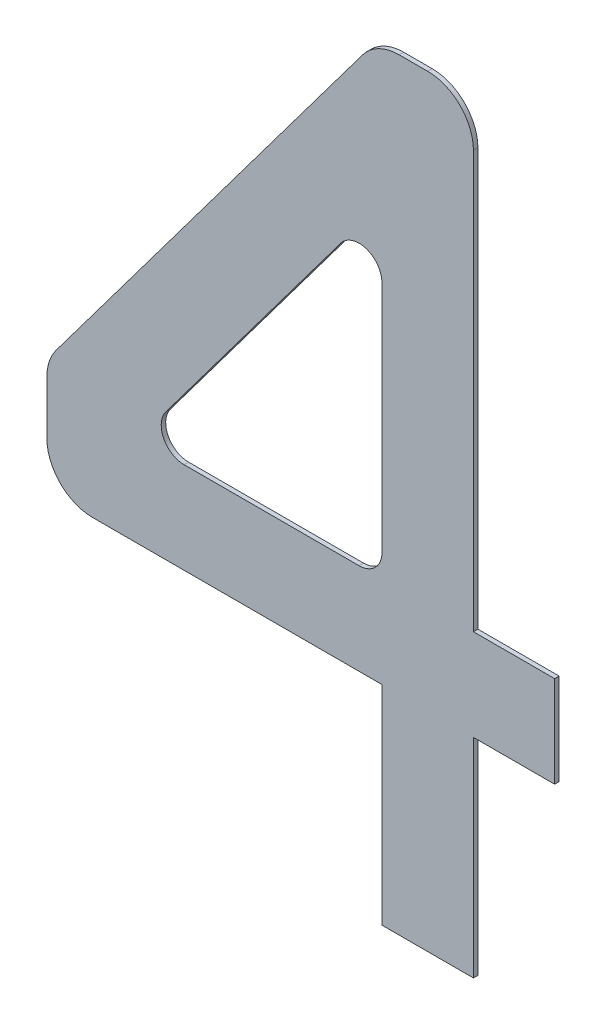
ISO-10303-21;
HEADER;
FILE_DESCRIPTION(('STEP AP214'),'2;1');
FILE_NAME('part.step','',(''),(''),'','','');
FILE_SCHEMA(('AUTOMOTIVE_DESIGN { 1 0 10303 214 1 1 1 1 }'));
ENDSEC;
DATA;
#1=APPLICATION_CONTEXT('core data for automotive mechanical design processes');
#2=APPLICATION_PROTOCOL_DEFINITION('international standard','automotive_design',2000,#1);
#3=PRODUCT_CONTEXT('',#1,'mechanical');
#4=PRODUCT('Part','Part','',(#3));
#5=PRODUCT_RELATED_PRODUCT_CATEGORY('part','',(#4));
#6=PRODUCT_DEFINITION_FORMATION('','',#4);
#7=PRODUCT_DEFINITION_CONTEXT('part definition',#1,'design');
#8=PRODUCT_DEFINITION('design','',#6,#7);
#9=PRODUCT_DEFINITION_SHAPE('','',#8);
#10=(LENGTH_UNIT() NAMED_UNIT(*) SI_UNIT(.MILLI.,.METRE.));
#11=(NAMED_UNIT(*) PLANE_ANGLE_UNIT() SI_UNIT($,.RADIAN.));
#12=(NAMED_UNIT(*) SI_UNIT($,.STERADIAN.) SOLID_ANGLE_UNIT());
#13=UNCERTAINTY_MEASURE_WITH_UNIT(LENGTH_MEASURE(1.E-05),#10,'distance_accuracy_value','');
#14=(GEOMETRIC_REPRESENTATION_CONTEXT(3) GLOBAL_UNCERTAINTY_ASSIGNED_CONTEXT((#13)) GLOBAL_UNIT_ASSIGNED_CONTEXT((#10,
#11,#12)) REPRESENTATION_CONTEXT('',''));
#15=CARTESIAN_POINT('',(0.,0.,0.));
#16=DIRECTION('',(0.,0.,1.));
#17=DIRECTION('',(1.,0.,0.));
#18=AXIS2_PLACEMENT_3D('',#15,#16,#17);
#19=CARTESIAN_POINT('',(2.19559999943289,15.98,0.1));
#20=DIRECTION('',(0.,0.,1.));
#21=DIRECTION('',(1.,0.,0.));
#22=AXIS2_PLACEMENT_3D('',#19,#20,#21);
#23=PLANE('',#22);
#24=CARTESIAN_POINT('',(2.19559999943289,15.98,0.1));
#25=DIRECTION('',(0.,0.,1.));
#26=DIRECTION('',(1.,0.,0.));
#27=AXIS2_PLACEMENT_3D('',#24,#25,#26);
#28=CIRCLE('',#27,1.02);
#29=CARTESIAN_POINT('',(2.19559999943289,17.,0.1));
#30=VERTEX_POINT('',#29);
#31=CARTESIAN_POINT('',(1.37930622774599,16.5916081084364,0.1));
#32=VERTEX_POINT('',#31);
#33=EDGE_CURVE('E280',#30,#32,#28,.T.);
#34=ORIENTED_EDGE('',*,*,#33,.T.);
#35=DIRECTION('',(0.599615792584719,0.80028801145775,0.));
#36=VECTOR('',#35,1.);
#37=CARTESIAN_POINT('',(-5.4572937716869,7.46701685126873,0.1));
#38=LINE('',#37,#36);
#39=CARTESIAN_POINT('',(-5.4572937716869,7.46701685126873,0.1));
#40=VERTEX_POINT('',#39);
#41=EDGE_CURVE('E282',#40,#32,#38,.T.);
#42=ORIENTED_EDGE('',*,*,#41,.F.);
#43=CARTESIAN_POINT('',(-4.641,6.85540874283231,0.1));
#44=DIRECTION('',(0.,0.,1.));
#45=DIRECTION('',(1.,0.,0.));
#46=AXIS2_PLACEMENT_3D('',#43,#44,#45);
#47=CIRCLE('',#46,1.02);
#48=CARTESIAN_POINT('',(-5.661,6.85540874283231,0.1));
#49=VERTEX_POINT('',#48);
#50=EDGE_CURVE('E286',#40,#49,#47,.T.);
#51=ORIENTED_EDGE('',*,*,#50,.T.);
#52=DIRECTION('',(0.,-1.,0.));
#53=VECTOR('',#52,1.);
#54=CARTESIAN_POINT('',(-5.661,6.85540874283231,0.1));
#55=LINE('',#54,#53);
#56=CARTESIAN_POINT('',(-5.661,5.66666666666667,0.1));
#57=VERTEX_POINT('',#56);
#58=EDGE_CURVE('E289',#49,#57,#55,.T.);
#59=ORIENTED_EDGE('',*,*,#58,.T.);
#60=CARTESIAN_POINT('',(-4.641,5.66666666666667,0.1));
#61=DIRECTION('',(0.,0.,1.));
#62=DIRECTION('',(1.,0.,0.));
#63=AXIS2_PLACEMENT_3D('',#60,#61,#62);
#64=CIRCLE('',#63,1.02);
#65=CARTESIAN_POINT('',(-4.641,4.64666666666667,0.1));
#66=VERTEX_POINT('',#65);
#67=EDGE_CURVE('E292',#57,#66,#64,.T.);
#68=ORIENTED_EDGE('',*,*,#67,.T.);
#69=DIRECTION('',(1.,0.,0.));
#70=VECTOR('',#69,1.);
#71=CARTESIAN_POINT('',(-4.641,4.64666666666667,0.1));
#72=LINE('',#71,#70);
#73=CARTESIAN_POINT('',(1.8105,4.64666666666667,0.1));
#74=VERTEX_POINT('',#73);
#75=EDGE_CURVE('E295',#66,#74,#72,.T.);
#76=ORIENTED_EDGE('',*,*,#75,.T.);
#77=DIRECTION('',(0.,1.,0.));
#78=VECTOR('',#77,1.);
#79=CARTESIAN_POINT('',(1.8105,0.,0.1));
#80=LINE('',#79,#78);
#81=CARTESIAN_POINT('',(1.8105,0.,0.1));
#82=VERTEX_POINT('',#81);
#83=EDGE_CURVE('E298',#82,#74,#80,.T.);
#84=ORIENTED_EDGE('',*,*,#83,.F.);
#85=DIRECTION('',(1.,0.,0.));
#86=VECTOR('',#85,1.);
#87=CARTESIAN_POINT('',(1.8105,0.,0.1));
#88=LINE('',#87,#86);
#89=CARTESIAN_POINT('',(3.8505,0.,0.1));
#90=VERTEX_POINT('',#89);
#91=EDGE_CURVE('E302',#82,#90,#88,.T.);
#92=ORIENTED_EDGE('',*,*,#91,.T.);
#93=DIRECTION('',(0.,1.,0.));
#94=VECTOR('',#93,1.);
#95=CARTESIAN_POINT('',(3.8505,0.,0.1));
#96=LINE('',#95,#94);
#97=CARTESIAN_POINT('',(3.8505,4.64666666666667,0.1));
#98=VERTEX_POINT('',#97);
#99=EDGE_CURVE('E305',#90,#98,#96,.T.);
#100=ORIENTED_EDGE('',*,*,#99,.T.);
#101=DIRECTION('',(1.,0.,0.));
#102=VECTOR('',#101,1.);
#103=CARTESIAN_POINT('',(3.8505,4.64666666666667,0.1));
#104=LINE('',#103,#102);
#105=CARTESIAN_POINT('',(5.661,4.64666666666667,0.1));
#106=VERTEX_POINT('',#105);
#107=EDGE_CURVE('E308',#98,#106,#104,.T.);
#108=ORIENTED_EDGE('',*,*,#107,.T.);
#109=DIRECTION('',(0.,-1.,0.));
#110=VECTOR('',#109,1.);
#111=CARTESIAN_POINT('',(5.661,6.68666666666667,0.1));
#112=LINE('',#111,#110);
#113=CARTESIAN_POINT('',(5.661,6.68666666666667,0.1));
#114=VERTEX_POINT('',#113);
#115=EDGE_CURVE('E311',#114,#106,#112,.T.);
#116=ORIENTED_EDGE('',*,*,#115,.F.);
#117=DIRECTION('',(1.,0.,0.));
#118=VECTOR('',#117,1.);
#119=CARTESIAN_POINT('',(3.8505,6.68666666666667,0.1));
#120=LINE('',#119,#118);
#121=CARTESIAN_POINT('',(3.8505,6.68666666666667,0.1));
#122=VERTEX_POINT('',#121);
#123=EDGE_CURVE('E315',#122,#114,#120,.T.);
#124=ORIENTED_EDGE('',*,*,#123,.F.);
#125=DIRECTION('',(0.,1.,0.));
#126=VECTOR('',#125,1.);
#127=CARTESIAN_POINT('',(3.8505,6.68666666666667,0.1));
#128=LINE('',#127,#126);
#129=CARTESIAN_POINT('',(3.8505,15.98,0.1));
#130=VERTEX_POINT('',#129);
#131=EDGE_CURVE('E319',#122,#130,#128,.T.);
#132=ORIENTED_EDGE('',*,*,#131,.T.);
#133=CARTESIAN_POINT('',(2.8305,15.98,0.1));
#134=DIRECTION('',(0.,0.,1.));
#135=DIRECTION('',(1.,0.,0.));
#136=AXIS2_PLACEMENT_3D('',#133,#134,#135);
#137=CIRCLE('',#136,1.02);
#138=CARTESIAN_POINT('',(2.8305,17.,0.1));
#139=VERTEX_POINT('',#138);
#140=EDGE_CURVE('E322',#130,#139,#137,.T.);
#141=ORIENTED_EDGE('',*,*,#140,.T.);
#142=DIRECTION('',(-1.,0.,0.));
#143=VECTOR('',#142,1.);
#144=CARTESIAN_POINT('',(2.8305,17.,0.1));
#145=LINE('',#144,#143);
#146=EDGE_CURVE('E325',#139,#30,#145,.T.);
#147=ORIENTED_EDGE('',*,*,#146,.T.);
#148=EDGE_LOOP('',(#34,#42,#51,#59,#68,#76,#84,#92,#100,#108,#116,#124,#132,#141,#147));
#149=FACE_BOUND('',#148,.T.);
#150=CARTESIAN_POINT('',(1.3005,12.4046905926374,0.1));
#151=DIRECTION('',(0.,0.,1.));
#152=DIRECTION('',(1.,0.,0.));
#153=AXIS2_PLACEMENT_3D('',#150,#151,#152);
#154=CIRCLE('',#153,0.51);
#155=CARTESIAN_POINT('',(0.892353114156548,12.7104946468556,0.1));
#156=VERTEX_POINT('',#155);
#157=CARTESIAN_POINT('',(1.8105,12.4046905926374,0.1));
#158=VERTEX_POINT('',#157);
#159=EDGE_CURVE('E221',#156,#158,#154,.F.);
#160=ORIENTED_EDGE('',*,*,#159,.T.);
#161=DIRECTION('',(0.,-1.,0.));
#162=VECTOR('',#161,1.);
#163=CARTESIAN_POINT('',(1.8105,15.98,0.1));
#164=LINE('',#163,#162);
#165=CARTESIAN_POINT('',(1.8105,7.19666666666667,0.1));
#166=VERTEX_POINT('',#165);
#167=EDGE_CURVE('E213',#158,#166,#164,.T.);
#168=ORIENTED_EDGE('',*,*,#167,.T.);
#169=CARTESIAN_POINT('',(1.3005,7.19666666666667,0.1));
#170=DIRECTION('',(0.,0.,1.));
#171=DIRECTION('',(1.,0.,0.));
#172=AXIS2_PLACEMENT_3D('',#169,#170,#171);
#173=CIRCLE('',#172,0.51);
#174=CARTESIAN_POINT('',(1.3005,6.68666666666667,0.1));
#175=VERTEX_POINT('',#174);
#176=EDGE_CURVE('E201',#166,#175,#173,.F.);
#177=ORIENTED_EDGE('',*,*,#176,.T.);
#178=DIRECTION('',(1.,0.,0.));
#179=VECTOR('',#178,1.);
#180=CARTESIAN_POINT('',(2.19559999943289,6.68666666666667,0.1));
#181=LINE('',#180,#179);
#182=CARTESIAN_POINT('',(-2.60161192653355,6.68666666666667,0.1));
#183=VERTEX_POINT('',#182);
#184=EDGE_CURVE('E207',#183,#175,#181,.T.);
#185=ORIENTED_EDGE('',*,*,#184,.F.);
#186=CARTESIAN_POINT('',(-2.60161192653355,7.19666666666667,0.1));
#187=DIRECTION('',(0.,0.,1.));
#188=DIRECTION('',(1.,0.,0.));
#189=AXIS2_PLACEMENT_3D('',#186,#187,#188);
#190=CIRCLE('',#189,0.51);
#191=CARTESIAN_POINT('',(-3.00975881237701,7.50247072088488,0.1));
#192=VERTEX_POINT('',#191);
#193=EDGE_CURVE('E425',#183,#192,#190,.F.);
#194=ORIENTED_EDGE('',*,*,#193,.T.);
#195=DIRECTION('',(-0.599615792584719,-0.80028801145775,0.));
#196=VECTOR('',#195,1.);
#197=CARTESIAN_POINT('',(2.92984359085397,15.4298679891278,0.1));
#198=LINE('',#197,#196);
#199=EDGE_CURVE('E231',#156,#192,#198,.T.);
#200=ORIENTED_EDGE('',*,*,#199,.F.);
#201=EDGE_LOOP('',(#160,#168,#177,#185,#194,#200));
#202=FACE_BOUND('',#201,.T.);
#203=ADVANCED_FACE('F14',(#149,#202),#23,.T.);
#204=CARTESIAN_POINT('',(2.19559999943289,15.98,0.));
#205=DIRECTION('',(0.,0.,1.));
#206=DIRECTION('',(1.,0.,0.));
#207=AXIS2_PLACEMENT_3D('',#204,#205,#206);
#208=PLANE('',#207);
#209=CARTESIAN_POINT('',(2.19559999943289,15.98,0.));
#210=DIRECTION('',(0.,0.,1.));
#211=DIRECTION('',(1.,0.,0.));
#212=AXIS2_PLACEMENT_3D('',#209,#210,#211);
#213=CIRCLE('',#212,1.02);
#214=CARTESIAN_POINT('',(2.19559999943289,17.,0.));
#215=VERTEX_POINT('',#214);
#216=CARTESIAN_POINT('',(1.37930622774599,16.5916081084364,0.));
#217=VERTEX_POINT('',#216);
#218=EDGE_CURVE('E223',#215,#217,#213,.T.);
#219=ORIENTED_EDGE('',*,*,#218,.F.);
#220=DIRECTION('',(-1.,0.,0.));
#221=VECTOR('',#220,1.);
#222=CARTESIAN_POINT('',(2.8305,17.,0.));
#223=LINE('',#222,#221);
#224=CARTESIAN_POINT('',(2.8305,17.,0.));
#225=VERTEX_POINT('',#224);
#226=EDGE_CURVE('E279',#225,#215,#223,.T.);
#227=ORIENTED_EDGE('',*,*,#226,.F.);
#228=CARTESIAN_POINT('',(2.8305,15.98,0.));
#229=DIRECTION('',(0.,0.,1.));
#230=DIRECTION('',(1.,0.,0.));
#231=AXIS2_PLACEMENT_3D('',#228,#229,#230);
#232=CIRCLE('',#231,1.02);
#233=CARTESIAN_POINT('',(3.8505,15.98,0.));
#234=VERTEX_POINT('',#233);
#235=EDGE_CURVE('E276',#234,#225,#232,.T.);
#236=ORIENTED_EDGE('',*,*,#235,.F.);
#237=DIRECTION('',(0.,1.,0.));
#238=VECTOR('',#237,1.);
#239=CARTESIAN_POINT('',(3.8505,6.68666666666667,0.));
#240=LINE('',#239,#238);
#241=CARTESIAN_POINT('',(3.8505,6.68666666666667,0.));
#242=VERTEX_POINT('',#241);
#243=EDGE_CURVE('E273',#242,#234,#240,.T.);
#244=ORIENTED_EDGE('',*,*,#243,.F.);
#245=DIRECTION('',(1.,0.,0.));
#246=VECTOR('',#245,1.);
#247=CARTESIAN_POINT('',(3.8505,6.68666666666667,0.));
#248=LINE('',#247,#246);
#249=CARTESIAN_POINT('',(5.661,6.68666666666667,0.));
#250=VERTEX_POINT('',#249);
#251=EDGE_CURVE('E269',#242,#250,#248,.T.);
#252=ORIENTED_EDGE('',*,*,#251,.T.);
#253=DIRECTION('',(0.,-1.,0.));
#254=VECTOR('',#253,1.);
#255=CARTESIAN_POINT('',(5.661,6.68666666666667,0.));
#256=LINE('',#255,#254);
#257=CARTESIAN_POINT('',(5.661,4.64666666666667,0.));
#258=VERTEX_POINT('',#257);
#259=EDGE_CURVE('E265',#250,#258,#256,.T.);
#260=ORIENTED_EDGE('',*,*,#259,.T.);
#261=DIRECTION('',(1.,0.,0.));
#262=VECTOR('',#261,1.);
#263=CARTESIAN_POINT('',(3.8505,4.64666666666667,0.));
#264=LINE('',#263,#262);
#265=CARTESIAN_POINT('',(3.8505,4.64666666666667,0.));
#266=VERTEX_POINT('',#265);
#267=EDGE_CURVE('E261',#266,#258,#264,.T.);
#268=ORIENTED_EDGE('',*,*,#267,.F.);
#269=DIRECTION('',(0.,1.,0.));
#270=VECTOR('',#269,1.);
#271=CARTESIAN_POINT('',(3.8505,0.,0.));
#272=LINE('',#271,#270);
#273=CARTESIAN_POINT('',(3.8505,0.,0.));
#274=VERTEX_POINT('',#273);
#275=EDGE_CURVE('E258',#274,#266,#272,.T.);
#276=ORIENTED_EDGE('',*,*,#275,.F.);
#277=DIRECTION('',(1.,0.,0.));
#278=VECTOR('',#277,1.);
#279=CARTESIAN_POINT('',(1.8105,0.,0.));
#280=LINE('',#279,#278);
#281=CARTESIAN_POINT('',(1.8105,0.,0.));
#282=VERTEX_POINT('',#281);
#283=EDGE_CURVE('E255',#282,#274,#280,.T.);
#284=ORIENTED_EDGE('',*,*,#283,.F.);
#285=DIRECTION('',(0.,1.,0.));
#286=VECTOR('',#285,1.);
#287=CARTESIAN_POINT('',(1.8105,0.,0.));
#288=LINE('',#287,#286);
#289=CARTESIAN_POINT('',(1.8105,4.64666666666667,0.));
#290=VERTEX_POINT('',#289);
#291=EDGE_CURVE('E251',#282,#290,#288,.T.);
#292=ORIENTED_EDGE('',*,*,#291,.T.);
#293=DIRECTION('',(1.,0.,0.));
#294=VECTOR('',#293,1.);
#295=CARTESIAN_POINT('',(-4.641,4.64666666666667,0.));
#296=LINE('',#295,#294);
#297=CARTESIAN_POINT('',(-4.641,4.64666666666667,0.));
#298=VERTEX_POINT('',#297);
#299=EDGE_CURVE('E247',#298,#290,#296,.T.);
#300=ORIENTED_EDGE('',*,*,#299,.F.);
#301=CARTESIAN_POINT('',(-4.641,5.66666666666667,0.));
#302=DIRECTION('',(0.,0.,1.));
#303=DIRECTION('',(1.,0.,0.));
#304=AXIS2_PLACEMENT_3D('',#301,#302,#303);
#305=CIRCLE('',#304,1.02);
#306=CARTESIAN_POINT('',(-5.661,5.66666666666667,0.));
#307=VERTEX_POINT('',#306);
#308=EDGE_CURVE('E244',#307,#298,#305,.T.);
#309=ORIENTED_EDGE('',*,*,#308,.F.);
#310=DIRECTION('',(0.,-1.,0.));
#311=VECTOR('',#310,1.);
#312=CARTESIAN_POINT('',(-5.661,6.85540874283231,0.));
#313=LINE('',#312,#311);
#314=CARTESIAN_POINT('',(-5.661,6.85540874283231,0.));
#315=VERTEX_POINT('',#314);
#316=EDGE_CURVE('E241',#315,#307,#313,.T.);
#317=ORIENTED_EDGE('',*,*,#316,.F.);
#318=CARTESIAN_POINT('',(-4.641,6.85540874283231,0.));
#319=DIRECTION('',(0.,0.,1.));
#320=DIRECTION('',(1.,0.,0.));
#321=AXIS2_PLACEMENT_3D('',#318,#319,#320);
#322=CIRCLE('',#321,1.02);
#323=CARTESIAN_POINT('',(-5.4572937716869,7.46701685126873,0.));
#324=VERTEX_POINT('',#323);
#325=EDGE_CURVE('E238',#324,#315,#322,.T.);
#326=ORIENTED_EDGE('',*,*,#325,.F.);
#327=DIRECTION('',(0.599615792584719,0.80028801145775,0.));
#328=VECTOR('',#327,1.);
#329=CARTESIAN_POINT('',(-5.4572937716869,7.46701685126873,0.));
#330=LINE('',#329,#328);
#331=EDGE_CURVE('E229',#324,#217,#330,.T.);
#332=ORIENTED_EDGE('',*,*,#331,.T.);
#333=EDGE_LOOP('',(#219,#227,#236,#244,#252,#260,#268,#276,#284,#292,#300,#309,#317,#326,#332));
#334=FACE_BOUND('',#333,.T.);
#335=DIRECTION('',(0.,-1.,0.));
#336=VECTOR('',#335,1.);
#337=CARTESIAN_POINT('',(1.8105,15.98,0.));
#338=LINE('',#337,#336);
#339=CARTESIAN_POINT('',(1.8105,12.4046905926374,0.));
#340=VERTEX_POINT('',#339);
#341=CARTESIAN_POINT('',(1.8105,7.19666666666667,0.));
#342=VERTEX_POINT('',#341);
#343=EDGE_CURVE('E9',#340,#342,#338,.T.);
#344=ORIENTED_EDGE('',*,*,#343,.F.);
#345=CARTESIAN_POINT('',(1.3005,12.4046905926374,0.));
#346=DIRECTION('',(0.,0.,1.));
#347=DIRECTION('',(1.,0.,0.));
#348=AXIS2_PLACEMENT_3D('',#345,#346,#347);
#349=CIRCLE('',#348,0.51);
#350=CARTESIAN_POINT('',(0.892353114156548,12.7104946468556,0.));
#351=VERTEX_POINT('',#350);
#352=EDGE_CURVE('E23',#351,#340,#349,.F.);
#353=ORIENTED_EDGE('',*,*,#352,.F.);
#354=DIRECTION('',(-0.599615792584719,-0.80028801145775,0.));
#355=VECTOR('',#354,1.);
#356=CARTESIAN_POINT('',(2.92984359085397,15.4298679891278,0.));
#357=LINE('',#356,#355);
#358=CARTESIAN_POINT('',(-3.00975881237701,7.50247072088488,0.));
#359=VERTEX_POINT('',#358);
#360=EDGE_CURVE('E393',#351,#359,#357,.T.);
#361=ORIENTED_EDGE('',*,*,#360,.T.);
#362=CARTESIAN_POINT('',(-2.60161192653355,7.19666666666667,0.));
#363=DIRECTION('',(0.,0.,1.));
#364=DIRECTION('',(1.,0.,0.));
#365=AXIS2_PLACEMENT_3D('',#362,#363,#364);
#366=CIRCLE('',#365,0.51);
#367=CARTESIAN_POINT('',(-2.60161192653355,6.68666666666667,0.));
#368=VERTEX_POINT('',#367);
#369=EDGE_CURVE('E390',#368,#359,#366,.F.);
#370=ORIENTED_EDGE('',*,*,#369,.F.);
#371=DIRECTION('',(1.,0.,0.));
#372=VECTOR('',#371,1.);
#373=CARTESIAN_POINT('',(2.19559999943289,6.68666666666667,0.));
#374=LINE('',#373,#372);
#375=CARTESIAN_POINT('',(1.3005,6.68666666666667,0.));
#376=VERTEX_POINT('',#375);
#377=EDGE_CURVE('E386',#368,#376,#374,.T.);
#378=ORIENTED_EDGE('',*,*,#377,.T.);
#379=CARTESIAN_POINT('',(1.3005,7.19666666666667,0.));
#380=DIRECTION('',(0.,0.,1.));
#381=DIRECTION('',(1.,0.,0.));
#382=AXIS2_PLACEMENT_3D('',#379,#380,#381);
#383=CIRCLE('',#382,0.51);
#384=EDGE_CURVE('E381',#342,#376,#383,.F.);
#385=ORIENTED_EDGE('',*,*,#384,.F.);
#386=EDGE_LOOP('',(#344,#353,#361,#370,#378,#385));
#387=FACE_BOUND('',#386,.T.);
#388=ADVANCED_FACE('F407',(#334,#387),#208,.F.);
#389=CARTESIAN_POINT('',(2.19559999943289,15.98,0.1));
#390=DIRECTION('',(0.,0.,-1.));
#391=DIRECTION('',(-1.,0.,0.));
#392=AXIS2_PLACEMENT_3D('',#389,#390,#391);
#393=CYLINDRICAL_SURFACE('',#392,1.02);
#394=ORIENTED_EDGE('',*,*,#218,.T.);
#395=DIRECTION('',(0.,0.,-1.));
#396=VECTOR('',#395,1.);
#397=CARTESIAN_POINT('',(1.37930622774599,16.5916081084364,0.1));
#398=LINE('',#397,#396);
#399=EDGE_CURVE('E378',#32,#217,#398,.T.);
#400=ORIENTED_EDGE('',*,*,#399,.F.);
#401=ORIENTED_EDGE('',*,*,#33,.F.);
#402=DIRECTION('',(0.,0.,-1.));
#403=VECTOR('',#402,1.);
#404=CARTESIAN_POINT('',(2.19559999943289,17.,0.1));
#405=LINE('',#404,#403);
#406=EDGE_CURVE('E328',#30,#215,#405,.T.);
#407=ORIENTED_EDGE('',*,*,#406,.T.);
#408=EDGE_LOOP('',(#394,#400,#401,#407));
#409=FACE_BOUND('',#408,.T.);
#410=ADVANCED_FACE('F16',(#409),#393,.T.);
#411=CARTESIAN_POINT('',(-5.4572937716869,7.46701685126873,0.1));
#412=DIRECTION('',(-0.80028801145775,0.599615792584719,0.));
#413=DIRECTION('',(-0.599615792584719,-0.80028801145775,0.));
#414=AXIS2_PLACEMENT_3D('',#411,#412,#413);
#415=PLANE('',#414);
#416=ORIENTED_EDGE('',*,*,#331,.F.);
#417=DIRECTION('',(0.,0.,-1.));
#418=VECTOR('',#417,1.);
#419=CARTESIAN_POINT('',(-5.4572937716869,7.46701685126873,0.1));
#420=LINE('',#419,#418);
#421=EDGE_CURVE('E377',#40,#324,#420,.T.);
#422=ORIENTED_EDGE('',*,*,#421,.F.);
#423=ORIENTED_EDGE('',*,*,#41,.T.);
#424=ORIENTED_EDGE('',*,*,#399,.T.);
#425=EDGE_LOOP('',(#416,#422,#423,#424));
#426=FACE_BOUND('',#425,.T.);
#427=ADVANCED_FACE('F630',(#426),#415,.T.);
#428=CARTESIAN_POINT('',(-4.641,6.85540874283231,0.1));
#429=DIRECTION('',(0.,0.,-1.));
#430=DIRECTION('',(-1.,0.,0.));
#431=AXIS2_PLACEMENT_3D('',#428,#429,#430);
#432=CYLINDRICAL_SURFACE('',#431,1.02);
#433=ORIENTED_EDGE('',*,*,#325,.T.);
#434=DIRECTION('',(0.,0.,-1.));
#435=VECTOR('',#434,1.);
#436=CARTESIAN_POINT('',(-5.661,6.85540874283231,0.1));
#437=LINE('',#436,#435);
#438=EDGE_CURVE('E373',#49,#315,#437,.T.);
#439=ORIENTED_EDGE('',*,*,#438,.F.);
#440=ORIENTED_EDGE('',*,*,#50,.F.);
#441=ORIENTED_EDGE('',*,*,#421,.T.);
#442=EDGE_LOOP('',(#433,#439,#440,#441));
#443=FACE_BOUND('',#442,.T.);
#444=ADVANCED_FACE('F620',(#443),#432,.T.);
#445=CARTESIAN_POINT('',(-5.661,6.85540874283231,0.1));
#446=DIRECTION('',(1.,0.,0.));
#447=DIRECTION('',(0.,0.,-1.));
#448=AXIS2_PLACEMENT_3D('',#445,#446,#447);
#449=PLANE('',#448);
#450=ORIENTED_EDGE('',*,*,#316,.T.);
#451=DIRECTION('',(0.,0.,-1.));
#452=VECTOR('',#451,1.);
#453=CARTESIAN_POINT('',(-5.661,5.66666666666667,0.1));
#454=LINE('',#453,#452);
#455=EDGE_CURVE('E369',#57,#307,#454,.T.);
#456=ORIENTED_EDGE('',*,*,#455,.F.);
#457=ORIENTED_EDGE('',*,*,#58,.F.);
#458=ORIENTED_EDGE('',*,*,#438,.T.);
#459=EDGE_LOOP('',(#450,#456,#457,#458));
#460=FACE_BOUND('',#459,.T.);
#461=ADVANCED_FACE('F610',(#460),#449,.F.);
#462=CARTESIAN_POINT('',(-4.641,5.66666666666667,0.1));
#463=DIRECTION('',(0.,0.,-1.));
#464=DIRECTION('',(-1.,0.,0.));
#465=AXIS2_PLACEMENT_3D('',#462,#463,#464);
#466=CYLINDRICAL_SURFACE('',#465,1.02);
#467=ORIENTED_EDGE('',*,*,#308,.T.);
#468=DIRECTION('',(0.,0.,-1.));
#469=VECTOR('',#468,1.);
#470=CARTESIAN_POINT('',(-4.641,4.64666666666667,0.1));
#471=LINE('',#470,#469);
#472=EDGE_CURVE('E365',#66,#298,#471,.T.);
#473=ORIENTED_EDGE('',*,*,#472,.F.);
#474=ORIENTED_EDGE('',*,*,#67,.F.);
#475=ORIENTED_EDGE('',*,*,#455,.T.);
#476=EDGE_LOOP('',(#467,#473,#474,#475));
#477=FACE_BOUND('',#476,.T.);
#478=ADVANCED_FACE('F600',(#477),#466,.T.);
#479=CARTESIAN_POINT('',(-4.641,4.64666666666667,0.1));
#480=DIRECTION('',(0.,1.,0.));
#481=DIRECTION('',(0.,0.,1.));
#482=AXIS2_PLACEMENT_3D('',#479,#480,#481);
#483=PLANE('',#482);
#484=ORIENTED_EDGE('',*,*,#299,.T.);
#485=DIRECTION('',(0.,0.,-1.));
#486=VECTOR('',#485,1.);
#487=CARTESIAN_POINT('',(1.8105,4.64666666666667,0.1));
#488=LINE('',#487,#486);
#489=EDGE_CURVE('E362',#74,#290,#488,.T.);
#490=ORIENTED_EDGE('',*,*,#489,.F.);
#491=ORIENTED_EDGE('',*,*,#75,.F.);
#492=ORIENTED_EDGE('',*,*,#472,.T.);
#493=EDGE_LOOP('',(#484,#490,#491,#492));
#494=FACE_BOUND('',#493,.T.);
#495=ADVANCED_FACE('F590',(#494),#483,.F.);
#496=CARTESIAN_POINT('',(1.8105,0.,0.1));
#497=DIRECTION('',(-1.,0.,0.));
#498=DIRECTION('',(0.,-1.,0.));
#499=AXIS2_PLACEMENT_3D('',#496,#497,#498);
#500=PLANE('',#499);
#501=ORIENTED_EDGE('',*,*,#291,.F.);
#502=DIRECTION('',(0.,0.,-1.));
#503=VECTOR('',#502,1.);
#504=CARTESIAN_POINT('',(1.8105,0.,0.1));
#505=LINE('',#504,#503);
#506=EDGE_CURVE('E359',#82,#282,#505,.T.);
#507=ORIENTED_EDGE('',*,*,#506,.F.);
#508=ORIENTED_EDGE('',*,*,#83,.T.);
#509=ORIENTED_EDGE('',*,*,#489,.T.);
#510=EDGE_LOOP('',(#501,#507,#508,#509));
#511=FACE_BOUND('',#510,.T.);
#512=ADVANCED_FACE('F580',(#511),#500,.T.);
#513=CARTESIAN_POINT('',(1.8105,0.,0.1));
#514=DIRECTION('',(0.,1.,0.));
#515=DIRECTION('',(0.,0.,1.));
#516=AXIS2_PLACEMENT_3D('',#513,#514,#515);
#517=PLANE('',#516);
#518=ORIENTED_EDGE('',*,*,#283,.T.);
#519=DIRECTION('',(0.,0.,-1.));
#520=VECTOR('',#519,1.);
#521=CARTESIAN_POINT('',(3.8505,0.,0.1));
#522=LINE('',#521,#520);
#523=EDGE_CURVE('E355',#90,#274,#522,.T.);
#524=ORIENTED_EDGE('',*,*,#523,.F.);
#525=ORIENTED_EDGE('',*,*,#91,.F.);
#526=ORIENTED_EDGE('',*,*,#506,.T.);
#527=EDGE_LOOP('',(#518,#524,#525,#526));
#528=FACE_BOUND('',#527,.T.);
#529=ADVANCED_FACE('F570',(#528),#517,.F.);
#530=CARTESIAN_POINT('',(3.8505,0.,0.1));
#531=DIRECTION('',(-1.,0.,0.));
#532=DIRECTION('',(0.,-1.,0.));
#533=AXIS2_PLACEMENT_3D('',#530,#531,#532);
#534=PLANE('',#533);
#535=ORIENTED_EDGE('',*,*,#275,.T.);
#536=DIRECTION('',(0.,0.,-1.));
#537=VECTOR('',#536,1.);
#538=CARTESIAN_POINT('',(3.8505,4.64666666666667,0.1));
#539=LINE('',#538,#537);
#540=EDGE_CURVE('E351',#98,#266,#539,.T.);
#541=ORIENTED_EDGE('',*,*,#540,.F.);
#542=ORIENTED_EDGE('',*,*,#99,.F.);
#543=ORIENTED_EDGE('',*,*,#523,.T.);
#544=EDGE_LOOP('',(#535,#541,#542,#543));
#545=FACE_BOUND('',#544,.T.);
#546=ADVANCED_FACE('F560',(#545),#534,.F.);
#547=CARTESIAN_POINT('',(3.8505,4.64666666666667,0.1));
#548=DIRECTION('',(0.,1.,0.));
#549=DIRECTION('',(0.,0.,1.));
#550=AXIS2_PLACEMENT_3D('',#547,#548,#549);
#551=PLANE('',#550);
#552=ORIENTED_EDGE('',*,*,#267,.T.);
#553=DIRECTION('',(0.,0.,-1.));
#554=VECTOR('',#553,1.);
#555=CARTESIAN_POINT('',(5.661,4.64666666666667,0.1));
#556=LINE('',#555,#554);
#557=EDGE_CURVE('E348',#106,#258,#556,.T.);
#558=ORIENTED_EDGE('',*,*,#557,.F.);
#559=ORIENTED_EDGE('',*,*,#107,.F.);
#560=ORIENTED_EDGE('',*,*,#540,.T.);
#561=EDGE_LOOP('',(#552,#558,#559,#560));
#562=FACE_BOUND('',#561,.T.);
#563=ADVANCED_FACE('F550',(#562),#551,.F.);
#564=CARTESIAN_POINT('',(5.661,6.68666666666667,0.1));
#565=DIRECTION('',(1.,0.,0.));
#566=DIRECTION('',(0.,1.,0.));
#567=AXIS2_PLACEMENT_3D('',#564,#565,#566);
#568=PLANE('',#567);
#569=ORIENTED_EDGE('',*,*,#259,.F.);
#570=DIRECTION('',(0.,0.,-1.));
#571=VECTOR('',#570,1.);
#572=CARTESIAN_POINT('',(5.661,6.68666666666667,0.1));
#573=LINE('',#572,#571);
#574=EDGE_CURVE('E345',#114,#250,#573,.T.);
#575=ORIENTED_EDGE('',*,*,#574,.F.);
#576=ORIENTED_EDGE('',*,*,#115,.T.);
#577=ORIENTED_EDGE('',*,*,#557,.T.);
#578=EDGE_LOOP('',(#569,#575,#576,#577));
#579=FACE_BOUND('',#578,.T.);
#580=ADVANCED_FACE('F540',(#579),#568,.T.);
#581=CARTESIAN_POINT('',(3.8505,6.68666666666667,0.1));
#582=DIRECTION('',(0.,1.,0.));
#583=DIRECTION('',(0.,0.,1.));
#584=AXIS2_PLACEMENT_3D('',#581,#582,#583);
#585=PLANE('',#584);
#586=ORIENTED_EDGE('',*,*,#251,.F.);
#587=DIRECTION('',(0.,0.,-1.));
#588=VECTOR('',#587,1.);
#589=CARTESIAN_POINT('',(3.8505,6.68666666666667,0.1));
#590=LINE('',#589,#588);
#591=EDGE_CURVE('E342',#122,#242,#590,.T.);
#592=ORIENTED_EDGE('',*,*,#591,.F.);
#593=ORIENTED_EDGE('',*,*,#123,.T.);
#594=ORIENTED_EDGE('',*,*,#574,.T.);
#595=EDGE_LOOP('',(#586,#592,#593,#594));
#596=FACE_BOUND('',#595,.T.);
#597=ADVANCED_FACE('F530',(#596),#585,.T.);
#598=CARTESIAN_POINT('',(3.8505,6.68666666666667,0.1));
#599=DIRECTION('',(-1.,0.,0.));
#600=DIRECTION('',(0.,-1.,0.));
#601=AXIS2_PLACEMENT_3D('',#598,#599,#600);
#602=PLANE('',#601);
#603=ORIENTED_EDGE('',*,*,#243,.T.);
#604=DIRECTION('',(0.,0.,-1.));
#605=VECTOR('',#604,1.);
#606=CARTESIAN_POINT('',(3.8505,15.98,0.1));
#607=LINE('',#606,#605);
#608=EDGE_CURVE('E338',#130,#234,#607,.T.);
#609=ORIENTED_EDGE('',*,*,#608,.F.);
#610=ORIENTED_EDGE('',*,*,#131,.F.);
#611=ORIENTED_EDGE('',*,*,#591,.T.);
#612=EDGE_LOOP('',(#603,#609,#610,#611));
#613=FACE_BOUND('',#612,.T.);
#614=ADVANCED_FACE('F520',(#613),#602,.F.);
#615=CARTESIAN_POINT('',(2.8305,15.98,0.1));
#616=DIRECTION('',(0.,0.,-1.));
#617=DIRECTION('',(-1.,0.,0.));
#618=AXIS2_PLACEMENT_3D('',#615,#616,#617);
#619=CYLINDRICAL_SURFACE('',#618,1.02);
#620=ORIENTED_EDGE('',*,*,#235,.T.);
#621=DIRECTION('',(0.,0.,-1.));
#622=VECTOR('',#621,1.);
#623=CARTESIAN_POINT('',(2.8305,17.,0.1));
#624=LINE('',#623,#622);
#625=EDGE_CURVE('E334',#139,#225,#624,.T.);
#626=ORIENTED_EDGE('',*,*,#625,.F.);
#627=ORIENTED_EDGE('',*,*,#140,.F.);
#628=ORIENTED_EDGE('',*,*,#608,.T.);
#629=EDGE_LOOP('',(#620,#626,#627,#628));
#630=FACE_BOUND('',#629,.T.);
#631=ADVANCED_FACE('F508',(#630),#619,.T.);
#632=CARTESIAN_POINT('',(2.8305,17.,0.1));
#633=DIRECTION('',(0.,-1.,0.));
#634=DIRECTION('',(1.,0.,0.));
#635=AXIS2_PLACEMENT_3D('',#632,#633,#634);
#636=PLANE('',#635);
#637=ORIENTED_EDGE('',*,*,#226,.T.);
#638=ORIENTED_EDGE('',*,*,#406,.F.);
#639=ORIENTED_EDGE('',*,*,#146,.F.);
#640=ORIENTED_EDGE('',*,*,#625,.T.);
#641=EDGE_LOOP('',(#637,#638,#639,#640));
#642=FACE_BOUND('',#641,.T.);
#643=ADVANCED_FACE('F502',(#642),#636,.F.);
#644=CARTESIAN_POINT('',(1.8105,7.19666666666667,1.1));
#645=DIRECTION('',(-1.,0.,0.));
#646=DIRECTION('',(0.,0.,1.));
#647=AXIS2_PLACEMENT_3D('',#644,#645,#646);
#648=PLANE('',#647);
#649=DIRECTION('',(0.,0.,-1.));
#650=VECTOR('',#649,1.);
#651=CARTESIAN_POINT('',(1.8105,12.4046905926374,1.1));
#652=LINE('',#651,#650);
#653=EDGE_CURVE('E208',#158,#340,#652,.T.);
#654=ORIENTED_EDGE('',*,*,#653,.T.);
#655=ORIENTED_EDGE('',*,*,#343,.T.);
#656=DIRECTION('',(0.,0.,-1.));
#657=VECTOR('',#656,1.);
#658=CARTESIAN_POINT('',(1.8105,7.19666666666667,1.1));
#659=LINE('',#658,#657);
#660=EDGE_CURVE('E44',#166,#342,#659,.T.);
#661=ORIENTED_EDGE('',*,*,#660,.F.);
#662=ORIENTED_EDGE('',*,*,#167,.F.);
#663=EDGE_LOOP('',(#654,#655,#661,#662));
#664=FACE_BOUND('',#663,.T.);
#665=ADVANCED_FACE('F212',(#664),#648,.T.);
#666=CARTESIAN_POINT('',(1.3005,12.4046905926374,1.1));
#667=DIRECTION('',(0.,0.,-1.));
#668=DIRECTION('',(-1.,0.,0.));
#669=AXIS2_PLACEMENT_3D('',#666,#667,#668);
#670=CYLINDRICAL_SURFACE('',#669,0.51);
#671=DIRECTION('',(0.,0.,-1.));
#672=VECTOR('',#671,1.);
#673=CARTESIAN_POINT('',(0.892353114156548,12.7104946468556,1.1));
#674=LINE('',#673,#672);
#675=EDGE_CURVE('E403',#156,#351,#674,.T.);
#676=ORIENTED_EDGE('',*,*,#675,.T.);
#677=ORIENTED_EDGE('',*,*,#352,.T.);
#678=ORIENTED_EDGE('',*,*,#653,.F.);
#679=ORIENTED_EDGE('',*,*,#159,.F.);
#680=EDGE_LOOP('',(#676,#677,#678,#679));
#681=FACE_BOUND('',#680,.T.);
#682=ADVANCED_FACE('F401',(#681),#670,.F.);
#683=CARTESIAN_POINT('',(-3.00975881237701,7.50247072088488,1.1));
#684=DIRECTION('',(-0.80028801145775,0.599615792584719,0.));
#685=DIRECTION('',(-0.599615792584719,-0.80028801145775,0.));
#686=AXIS2_PLACEMENT_3D('',#683,#684,#685);
#687=PLANE('',#686);
#688=ORIENTED_EDGE('',*,*,#199,.T.);
#689=DIRECTION('',(0.,0.,-1.));
#690=VECTOR('',#689,1.);
#691=CARTESIAN_POINT('',(-3.00975881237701,7.50247072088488,1.1));
#692=LINE('',#691,#690);
#693=EDGE_CURVE('E420',#192,#359,#692,.T.);
#694=ORIENTED_EDGE('',*,*,#693,.T.);
#695=ORIENTED_EDGE('',*,*,#360,.F.);
#696=ORIENTED_EDGE('',*,*,#675,.F.);
#697=EDGE_LOOP('',(#688,#694,#695,#696));
#698=FACE_BOUND('',#697,.T.);
#699=ADVANCED_FACE('F434',(#698),#687,.F.);
#700=CARTESIAN_POINT('',(-2.60161192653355,7.19666666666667,1.1));
#701=DIRECTION('',(0.,0.,-1.));
#702=DIRECTION('',(-1.,0.,0.));
#703=AXIS2_PLACEMENT_3D('',#700,#701,#702);
#704=CYLINDRICAL_SURFACE('',#703,0.51);
#705=DIRECTION('',(0.,0.,-1.));
#706=VECTOR('',#705,1.);
#707=CARTESIAN_POINT('',(-2.60161192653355,6.68666666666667,1.1));
#708=LINE('',#707,#706);
#709=EDGE_CURVE('E414',#183,#368,#708,.T.);
#710=ORIENTED_EDGE('',*,*,#709,.T.);
#711=ORIENTED_EDGE('',*,*,#369,.T.);
#712=ORIENTED_EDGE('',*,*,#693,.F.);
#713=ORIENTED_EDGE('',*,*,#193,.F.);
#714=EDGE_LOOP('',(#710,#711,#712,#713));
#715=FACE_BOUND('',#714,.T.);
#716=ADVANCED_FACE('F436',(#715),#704,.F.);
#717=CARTESIAN_POINT('',(1.3005,6.68666666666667,1.1));
#718=DIRECTION('',(0.,-1.,0.));
#719=DIRECTION('',(1.,0.,0.));
#720=AXIS2_PLACEMENT_3D('',#717,#718,#719);
#721=PLANE('',#720);
#722=ORIENTED_EDGE('',*,*,#184,.T.);
#723=DIRECTION('',(0.,0.,-1.));
#724=VECTOR('',#723,1.);
#725=CARTESIAN_POINT('',(1.3005,6.68666666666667,1.1));
#726=LINE('',#725,#724);
#727=EDGE_CURVE('E35',#175,#376,#726,.T.);
#728=ORIENTED_EDGE('',*,*,#727,.T.);
#729=ORIENTED_EDGE('',*,*,#377,.F.);
#730=ORIENTED_EDGE('',*,*,#709,.F.);
#731=EDGE_LOOP('',(#722,#728,#729,#730));
#732=FACE_BOUND('',#731,.T.);
#733=ADVANCED_FACE('F410',(#732),#721,.F.);
#734=CARTESIAN_POINT('',(1.3005,7.19666666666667,1.1));
#735=DIRECTION('',(0.,0.,-1.));
#736=DIRECTION('',(-1.,0.,0.));
#737=AXIS2_PLACEMENT_3D('',#734,#735,#736);
#738=CYLINDRICAL_SURFACE('',#737,0.51);
#739=ORIENTED_EDGE('',*,*,#660,.T.);
#740=ORIENTED_EDGE('',*,*,#384,.T.);
#741=ORIENTED_EDGE('',*,*,#727,.F.);
#742=ORIENTED_EDGE('',*,*,#176,.F.);
#743=EDGE_LOOP('',(#739,#740,#741,#742));
#744=FACE_BOUND('',#743,.T.);
#745=ADVANCED_FACE('F202',(#744),#738,.F.);
#746=CLOSED_SHELL('',(#203,#388,#410,#427,#444,#461,#478,#495,#512,#529,#546,#563,#580,#597,
#614,#631,#643,#665,#682,#699,#716,#733,#745));
#747=MANIFOLD_SOLID_BREP('B1',#746);
#748=ADVANCED_BREP_SHAPE_REPRESENTATION('',(#18,#747),#14);
#749=SHAPE_DEFINITION_REPRESENTATION(#9,#748);
ENDSEC;
END-ISO-10303-21;
